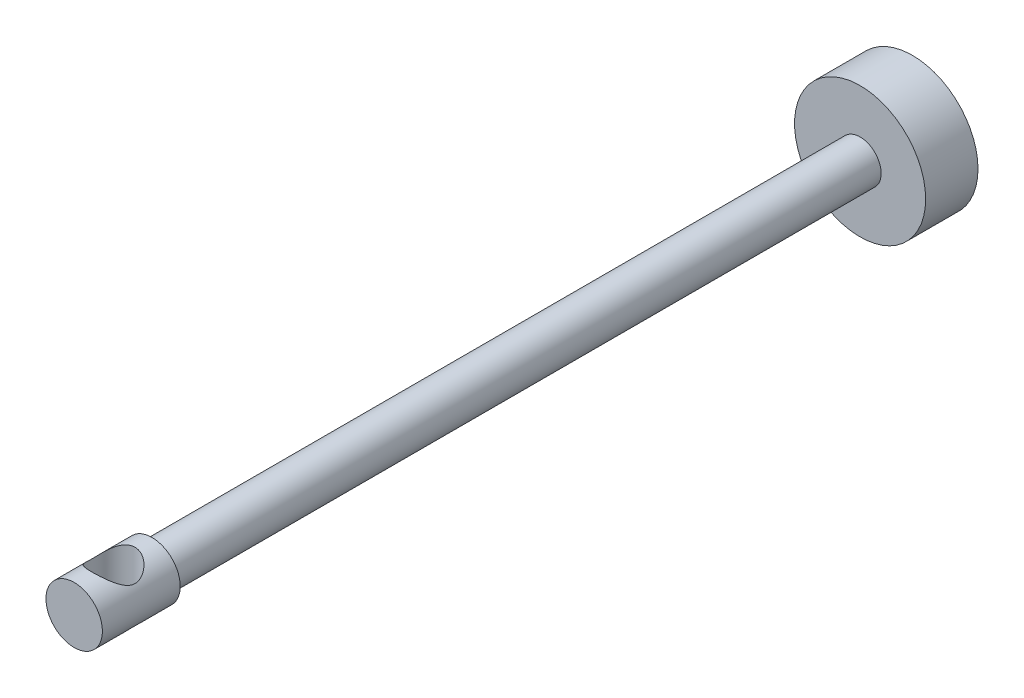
from build123d import *

# Parameters (mm, degrees)
SKETCH1_R               = 7.3152
EXTRUDE1_DEPTH          = 5.842
SKETCH2_R               = 2.3495
EXTRUDE2_DEPTH          = 93.5482
SKETCH3_R               = 3.1496
EXTRUDE3_DEPTH          = 8.6868
CUT_EXTRUDE1_DEPTH      = 95.118489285
CUT_EXTRUDE1_DEPTH_BACK = 95.118489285
SKETCH4_R               = 2.4003


with BuildPart() as part:
    # Sketch1 → Extrude1 (new body)
    with BuildSketch(Plane.XY):
        Circle(SKETCH1_R)
    extrude(amount=EXTRUDE1_DEPTH)

    # Sketch2 → Extrude2 (add)
    with BuildSketch(Plane.XY):
        Circle(SKETCH2_R)
    extrude(amount=EXTRUDE2_DEPTH)

    # Sketch3 → Extrude3 (add)
    with BuildSketch(Plane.XY.offset(93.5482)):
        Circle(SKETCH3_R)
    extrude(amount=-EXTRUDE3_DEPTH)

    # Sketch4 → Cut-Extrude1 (cut, two sides: drawn at the far end of the back side and taken through both)
    with BuildSketch(Plane(origin=(0, 0, 0), x_dir=(1, 0, 0), z_dir=(0, 1, 0)).offset(-CUT_EXTRUDE1_DEPTH_BACK)):
        with Locations(Location((0, -89.154, 0), (0, 0, 270))):
            Circle(SKETCH4_R)
    extrude(amount=CUT_EXTRUDE1_DEPTH + CUT_EXTRUDE1_DEPTH_BACK, mode=Mode.SUBTRACT)


solid = part.part
